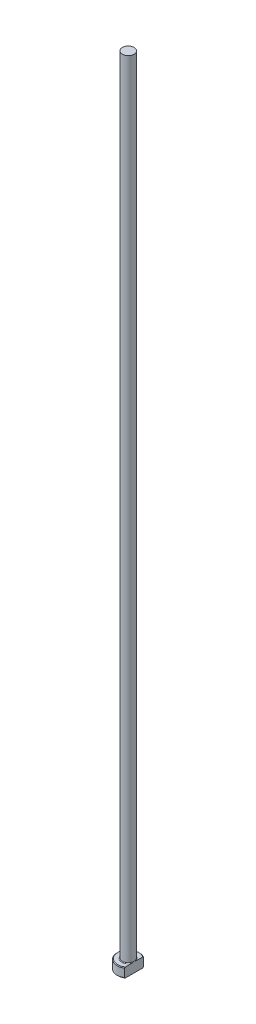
ISO-10303-21;
HEADER;
FILE_DESCRIPTION(('STEP AP214'),'2;1');
FILE_NAME('part.step','',(''),(''),'','','');
FILE_SCHEMA(('AUTOMOTIVE_DESIGN { 1 0 10303 214 1 1 1 1 }'));
ENDSEC;
DATA;
#1=APPLICATION_CONTEXT('core data for automotive mechanical design processes');
#2=APPLICATION_PROTOCOL_DEFINITION('international standard','automotive_design',2000,#1);
#3=PRODUCT_CONTEXT('',#1,'mechanical');
#4=PRODUCT('Part','Part','',(#3));
#5=PRODUCT_RELATED_PRODUCT_CATEGORY('part','',(#4));
#6=PRODUCT_DEFINITION_FORMATION('','',#4);
#7=PRODUCT_DEFINITION_CONTEXT('part definition',#1,'design');
#8=PRODUCT_DEFINITION('design','',#6,#7);
#9=PRODUCT_DEFINITION_SHAPE('','',#8);
#10=(LENGTH_UNIT() NAMED_UNIT(*) SI_UNIT(.MILLI.,.METRE.));
#11=(NAMED_UNIT(*) PLANE_ANGLE_UNIT() SI_UNIT($,.RADIAN.));
#12=(NAMED_UNIT(*) SI_UNIT($,.STERADIAN.) SOLID_ANGLE_UNIT());
#13=UNCERTAINTY_MEASURE_WITH_UNIT(LENGTH_MEASURE(1.E-05),#10,'distance_accuracy_value','');
#14=(GEOMETRIC_REPRESENTATION_CONTEXT(3) GLOBAL_UNCERTAINTY_ASSIGNED_CONTEXT((#13)) GLOBAL_UNIT_ASSIGNED_CONTEXT((#10,
#11,#12)) REPRESENTATION_CONTEXT('',''));
#15=CARTESIAN_POINT('',(0.,0.,0.));
#16=DIRECTION('',(0.,0.,1.));
#17=DIRECTION('',(1.,0.,0.));
#18=AXIS2_PLACEMENT_3D('',#15,#16,#17);
#19=CARTESIAN_POINT('',(0.,0.,0.));
#20=DIRECTION('',(0.,-1.,0.));
#21=DIRECTION('',(0.,0.,-1.));
#22=AXIS2_PLACEMENT_3D('',#19,#20,#21);
#23=PLANE('',#22);
#24=CARTESIAN_POINT('',(0.,0.,0.));
#25=DIRECTION('',(0.,-1.,0.));
#26=DIRECTION('',(0.,0.,-1.));
#27=AXIS2_PLACEMENT_3D('',#24,#25,#26);
#28=CIRCLE('',#27,3.29999999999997);
#29=CARTESIAN_POINT('',(1.84999999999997,0.,2.73267268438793));
#30=VERTEX_POINT('',#29);
#31=CARTESIAN_POINT('',(1.84999999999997,0.,-2.73267268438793));
#32=VERTEX_POINT('',#31);
#33=EDGE_CURVE('E98',#30,#32,#28,.T.);
#34=ORIENTED_EDGE('',*,*,#33,.T.);
#35=DIRECTION('',(0.,0.,1.));
#36=VECTOR('',#35,1.);
#37=CARTESIAN_POINT('',(1.84999999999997,0.,-2.9711109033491));
#38=LINE('',#37,#36);
#39=EDGE_CURVE('E83',#32,#30,#38,.T.);
#40=ORIENTED_EDGE('',*,*,#39,.T.);
#41=EDGE_LOOP('',(#34,#40));
#42=FACE_BOUND('',#41,.T.);
#43=ADVANCED_FACE('F32',(#42),#23,.T.);
#44=CARTESIAN_POINT('',(0.,259.958771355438,0.));
#45=DIRECTION('',(0.,1.,0.));
#46=DIRECTION('',(0.,0.,1.));
#47=AXIS2_PLACEMENT_3D('',#44,#45,#46);
#48=CYLINDRICAL_SURFACE('',#47,3.49999999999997);
#49=CARTESIAN_POINT('',(0.,2.79999999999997,0.));
#50=DIRECTION('',(0.,1.,0.));
#51=DIRECTION('',(0.,0.,1.));
#52=AXIS2_PLACEMENT_3D('',#49,#50,#51);
#53=CIRCLE('',#52,3.49999999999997);
#54=CARTESIAN_POINT('',(1.84999999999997,2.79999999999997,2.9711109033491));
#55=VERTEX_POINT('',#54);
#56=CARTESIAN_POINT('',(1.84999999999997,2.79999999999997,-2.9711109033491));
#57=VERTEX_POINT('',#56);
#58=EDGE_CURVE('E104',#55,#57,#53,.F.);
#59=ORIENTED_EDGE('',*,*,#58,.T.);
#60=DIRECTION('',(0.,-1.,0.));
#61=VECTOR('',#60,1.);
#62=CARTESIAN_POINT('',(1.84999999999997,250.,-2.9711109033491));
#63=LINE('',#62,#61);
#64=CARTESIAN_POINT('',(1.84999999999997,0.199999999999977,-2.9711109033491));
#65=VERTEX_POINT('',#64);
#66=EDGE_CURVE('E183',#57,#65,#63,.T.);
#67=ORIENTED_EDGE('',*,*,#66,.T.);
#68=CARTESIAN_POINT('',(0.,0.199999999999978,0.));
#69=DIRECTION('',(0.,-1.,0.));
#70=DIRECTION('',(0.,0.,-1.));
#71=AXIS2_PLACEMENT_3D('',#68,#69,#70);
#72=CIRCLE('',#71,3.49999999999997);
#73=CARTESIAN_POINT('',(1.84999999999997,0.199999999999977,2.9711109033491));
#74=VERTEX_POINT('',#73);
#75=EDGE_CURVE('E100',#65,#74,#72,.F.);
#76=ORIENTED_EDGE('',*,*,#75,.T.);
#77=DIRECTION('',(0.,-1.,0.));
#78=VECTOR('',#77,1.);
#79=CARTESIAN_POINT('',(1.84999999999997,250.,2.9711109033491));
#80=LINE('',#79,#78);
#81=EDGE_CURVE('E93',#55,#74,#80,.T.);
#82=ORIENTED_EDGE('',*,*,#81,.F.);
#83=EDGE_LOOP('',(#59,#67,#76,#82));
#84=FACE_BOUND('',#83,.T.);
#85=ADVANCED_FACE('F158',(#84),#48,.T.);
#86=CARTESIAN_POINT('',(-3.49999999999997,3.,0.));
#87=DIRECTION('',(0.,1.,0.));
#88=DIRECTION('',(0.,0.,1.));
#89=AXIS2_PLACEMENT_3D('',#86,#87,#88);
#90=PLANE('',#89);
#91=CARTESIAN_POINT('',(0.,3.,0.));
#92=DIRECTION('',(0.,1.,0.));
#93=DIRECTION('',(0.,0.,1.));
#94=AXIS2_PLACEMENT_3D('',#91,#92,#93);
#95=CIRCLE('',#94,3.29999999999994);
#96=CARTESIAN_POINT('',(1.84999999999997,3.,-2.7326726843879));
#97=VERTEX_POINT('',#96);
#98=CARTESIAN_POINT('',(1.84999999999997,3.,2.7326726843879));
#99=VERTEX_POINT('',#98);
#100=EDGE_CURVE('E178',#97,#99,#95,.T.);
#101=ORIENTED_EDGE('',*,*,#100,.T.);
#102=DIRECTION('',(0.,0.,-1.));
#103=VECTOR('',#102,1.);
#104=CARTESIAN_POINT('',(1.84999999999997,3.,0.));
#105=LINE('',#104,#103);
#106=CARTESIAN_POINT('',(1.84999999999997,2.99999999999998,0.883176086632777));
#107=VERTEX_POINT('',#106);
#108=EDGE_CURVE('E57',#99,#107,#105,.T.);
#109=ORIENTED_EDGE('',*,*,#108,.T.);
#110=CARTESIAN_POINT('',(0.,3.,0.));
#111=DIRECTION('',(0.,1.,0.));
#112=DIRECTION('',(0.,0.,1.));
#113=AXIS2_PLACEMENT_3D('',#110,#111,#112);
#114=CIRCLE('',#113,2.04999999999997);
#115=CARTESIAN_POINT('',(1.84999999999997,2.99999999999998,-0.883176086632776));
#116=VERTEX_POINT('',#115);
#117=EDGE_CURVE('E107',#107,#116,#114,.F.);
#118=ORIENTED_EDGE('',*,*,#117,.T.);
#119=EDGE_CURVE('E136',#116,#97,#105,.T.);
#120=ORIENTED_EDGE('',*,*,#119,.T.);
#121=EDGE_LOOP('',(#101,#109,#118,#120));
#122=FACE_BOUND('',#121,.T.);
#123=ADVANCED_FACE('F147',(#122),#90,.T.);
#124=CARTESIAN_POINT('',(0.,3.,0.));
#125=DIRECTION('',(0.,-1.,0.));
#126=DIRECTION('',(0.,0.,-1.));
#127=AXIS2_PLACEMENT_3D('',#124,#125,#126);
#128=CONICAL_SURFACE('',#127,3.29999999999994,0.785398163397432);
#129=ORIENTED_EDGE('',*,*,#58,.F.);
#130=CARTESIAN_POINT('',(1.84999999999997,-0.495337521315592,6.53866286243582));
#131=CARTESIAN_POINT('',(1.84999999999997,-0.367557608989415,6.40586293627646));
#132=CARTESIAN_POINT('',(1.84999999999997,-0.239923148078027,6.27292282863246));
#133=CARTESIAN_POINT('',(1.84999999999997,0.0149855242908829,6.00669544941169));
#134=CARTESIAN_POINT('',(1.84999999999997,0.142259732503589,5.8734081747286));
#135=CARTESIAN_POINT('',(1.84999999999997,0.523515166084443,5.47284424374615));
#136=CARTESIAN_POINT('',(1.84999999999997,0.776848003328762,5.20494969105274));
#137=CARTESIAN_POINT('',(1.84999999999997,1.27905662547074,4.66864873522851));
#138=CARTESIAN_POINT('',(1.84999999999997,1.52795142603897,4.40026022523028));
#139=CARTESIAN_POINT('',(1.84999999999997,1.89802867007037,3.99472739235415));
#140=CARTESIAN_POINT('',(1.84999999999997,2.0208357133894,3.85906701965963));
#141=CARTESIAN_POINT('',(1.84999999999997,2.26498704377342,3.58643788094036));
#142=CARTESIAN_POINT('',(1.84999999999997,2.38633136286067,3.44946914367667));
#143=CARTESIAN_POINT('',(1.84999999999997,2.59253936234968,3.21326235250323));
#144=CARTESIAN_POINT('',(1.84999999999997,2.6778961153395,3.11445520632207));
#145=CARTESIAN_POINT('',(1.84999999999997,2.84729764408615,2.91570924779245));
#146=CARTESIAN_POINT('',(1.84999999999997,2.93134233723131,2.81577036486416));
#147=CARTESIAN_POINT('',(1.84999999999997,3.09808918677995,2.61399668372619));
#148=CARTESIAN_POINT('',(1.84999999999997,3.1807833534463,2.51215526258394));
#149=CARTESIAN_POINT('',(1.84999999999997,3.34381050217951,2.30661634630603));
#150=CARTESIAN_POINT('',(1.84999999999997,3.42414384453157,2.20291913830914));
#151=CARTESIAN_POINT('',(1.84999999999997,3.58217316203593,1.99223162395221));
#152=CARTESIAN_POINT('',(1.84999999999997,3.65984318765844,1.88522173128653));
#153=CARTESIAN_POINT('',(1.84999999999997,3.81046673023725,1.66776579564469));
#154=CARTESIAN_POINT('',(1.84999999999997,3.88341650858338,1.55731712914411));
#155=CARTESIAN_POINT('',(1.84999999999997,4.02186828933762,1.3323802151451));
#156=CARTESIAN_POINT('',(1.84999999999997,4.0873979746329,1.21790922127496));
#157=CARTESIAN_POINT('',(1.84999999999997,4.20734088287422,0.98328899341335));
#158=CARTESIAN_POINT('',(1.84999999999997,4.2617739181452,0.863150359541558));
#159=CARTESIAN_POINT('',(1.84999999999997,4.33092920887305,0.676855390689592));
#160=CARTESIAN_POINT('',(1.84999999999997,4.35204213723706,0.613084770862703));
#161=CARTESIAN_POINT('',(1.84999999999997,4.3887487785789,0.483954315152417));
#162=CARTESIAN_POINT('',(1.84999999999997,4.40434337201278,0.418594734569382));
#163=CARTESIAN_POINT('',(1.84999999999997,4.42895642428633,0.287118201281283));
#164=CARTESIAN_POINT('',(1.84999999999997,4.43802196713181,0.221010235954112));
#165=CARTESIAN_POINT('',(1.84999999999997,4.44908005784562,0.0882006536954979));
#166=CARTESIAN_POINT('',(1.84999999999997,4.4510736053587,0.0214991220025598));
#167=CARTESIAN_POINT('',(1.84999999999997,4.44782172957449,-0.111919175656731));
#168=CARTESIAN_POINT('',(1.84999999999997,4.44255503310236,-0.178635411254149));
#169=CARTESIAN_POINT('',(1.84999999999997,4.42516665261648,-0.311161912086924));
#170=CARTESIAN_POINT('',(1.84999999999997,4.41304353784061,-0.376971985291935));
#171=CARTESIAN_POINT('',(1.84999999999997,4.38266710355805,-0.507684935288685));
#172=CARTESIAN_POINT('',(1.84999999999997,4.36436596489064,-0.572576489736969));
#173=CARTESIAN_POINT('',(1.84999999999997,4.3226826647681,-0.700682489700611));
#174=CARTESIAN_POINT('',(1.84999999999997,4.29930023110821,-0.763896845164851));
#175=CARTESIAN_POINT('',(1.84999999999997,4.24376239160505,-0.900089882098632));
#176=CARTESIAN_POINT('',(1.84999999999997,4.21078445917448,-0.972729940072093));
#177=CARTESIAN_POINT('',(1.84999999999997,4.14042488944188,-1.11586336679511));
#178=CARTESIAN_POINT('',(1.84999999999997,4.10304078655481,-1.18635550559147));
#179=CARTESIAN_POINT('',(1.84999999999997,4.02485037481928,-1.32556755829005));
#180=CARTESIAN_POINT('',(1.84999999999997,3.98403800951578,-1.39428404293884));
#181=CARTESIAN_POINT('',(1.84999999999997,3.89981091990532,-1.53011006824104));
#182=CARTESIAN_POINT('',(1.84999999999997,3.85639567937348,-1.59721928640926));
#183=CARTESIAN_POINT('',(1.84999999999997,3.72220240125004,-1.79793775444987));
#184=CARTESIAN_POINT('',(1.84999999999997,3.62833192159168,-1.92947392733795));
#185=CARTESIAN_POINT('',(1.84999999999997,3.4356113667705,-2.18852608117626));
#186=CARTESIAN_POINT('',(1.84999999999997,3.33676758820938,-2.31604682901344));
#187=CARTESIAN_POINT('',(1.84999999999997,3.16173100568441,-2.53562533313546));
#188=CARTESIAN_POINT('',(1.84999999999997,3.0863122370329,-2.62830296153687));
#189=CARTESIAN_POINT('',(1.84999999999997,2.93402806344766,-2.81246185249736));
#190=CARTESIAN_POINT('',(1.84999999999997,2.8571626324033,-2.90394309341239));
#191=CARTESIAN_POINT('',(1.84999999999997,2.62487459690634,-3.17698997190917));
#192=CARTESIAN_POINT('',(1.84999999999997,2.46778137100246,-3.35713267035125));
#193=CARTESIAN_POINT('',(1.84999999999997,2.15058675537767,-3.71509804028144));
#194=CARTESIAN_POINT('',(1.84999999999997,1.99048215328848,-3.89291784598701));
#195=CARTESIAN_POINT('',(1.84999999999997,1.66834476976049,-4.24677354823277));
#196=CARTESIAN_POINT('',(1.84999999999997,1.50631214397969,-4.42280958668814));
#197=CARTESIAN_POINT('',(1.84999999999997,1.19192013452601,-4.76168963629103));
#198=CARTESIAN_POINT('',(1.84999999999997,1.03965111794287,-4.92461766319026));
#199=CARTESIAN_POINT('',(1.84999999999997,0.734208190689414,-5.24963033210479));
#200=CARTESIAN_POINT('',(1.84999999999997,0.581034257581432,-5.41171495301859));
#201=CARTESIAN_POINT('',(1.84999999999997,0.274298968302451,-5.73490774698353));
#202=CARTESIAN_POINT('',(1.84999999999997,0.120738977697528,-5.89601721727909));
#203=CARTESIAN_POINT('',(1.84999999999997,-0.186924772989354,-6.21770486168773));
#204=CARTESIAN_POINT('',(1.84999999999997,-0.341028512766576,-6.37828305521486));
#205=CARTESIAN_POINT('',(1.84999999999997,-0.495337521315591,-6.53866286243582));
#206=B_SPLINE_CURVE_WITH_KNOTS('',3,(#130,#131,#132,#133,#134,#135,#136,#137,#138,#139,#140,
#141,#142,#143,#144,#145,#146,#147,#148,#149,#150,#151,#152,#153,#154,#155,#156,#157,#158,#159,
#160,#161,#162,#163,#164,#165,#166,#167,#168,#169,#170,#171,#172,#173,#174,#175,#176,#177,#178,
#179,#180,#181,#182,#183,#184,#185,#186,#187,#188,#189,#190,#191,#192,#193,#194,#195,#196,#197,
#198,#199,#200,#201,#202,#203,#204,#205),.UNSPECIFIED.,.F.,.F.,(4,2,2,2,2,2,2,2,2,2,2,2,2,2,2,2,
2,2,2,2,2,2,2,2,2,2,2,2,2,2,2,2,2,2,2,2,2,4),(0.,0.552875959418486,1.10575688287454,
2.21186966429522,3.30993774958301,3.85890041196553,4.40785103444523,4.79955362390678,
5.1912807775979,5.58481647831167,5.97829180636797,6.37488572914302,6.77179001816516,
7.16716102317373,7.56181981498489,7.76314684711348,7.96444174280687,8.16427006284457,
8.36407013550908,8.56445688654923,8.76488546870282,8.96690240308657,9.16893016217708,
9.40805718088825,9.64731865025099,9.88701207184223,10.1267531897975,10.6113114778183,
11.0952709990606,11.4537140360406,11.812163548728,12.5291632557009,13.2469768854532,
13.9647329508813,14.6337450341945,15.3027737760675,15.9704792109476,16.6381599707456),.UNSPECIFIED.);
#207=EDGE_CURVE('E135',#55,#99,#206,.T.);
#208=ORIENTED_EDGE('',*,*,#207,.T.);
#209=ORIENTED_EDGE('',*,*,#100,.F.);
#210=EDGE_CURVE('E127',#97,#57,#206,.T.);
#211=ORIENTED_EDGE('',*,*,#210,.T.);
#212=EDGE_LOOP('',(#129,#208,#209,#211));
#213=FACE_BOUND('',#212,.T.);
#214=ADVANCED_FACE('F143',(#213),#128,.T.);
#215=CARTESIAN_POINT('',(0.,0.199999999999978,0.));
#216=DIRECTION('',(0.,1.,0.));
#217=DIRECTION('',(0.,0.,1.));
#218=AXIS2_PLACEMENT_3D('',#215,#216,#217);
#219=CONICAL_SURFACE('',#218,3.49999999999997,0.785398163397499);
#220=ORIENTED_EDGE('',*,*,#75,.F.);
#221=CARTESIAN_POINT('',(1.84999999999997,3.4953375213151,-6.53866286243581));
#222=CARTESIAN_POINT('',(1.84999999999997,3.36755760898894,-6.40586293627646));
#223=CARTESIAN_POINT('',(1.84999999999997,3.23992314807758,-6.27292282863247));
#224=CARTESIAN_POINT('',(1.84999999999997,2.98501447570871,-6.00669544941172));
#225=CARTESIAN_POINT('',(1.84999999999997,2.85774026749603,-5.87340817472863));
#226=CARTESIAN_POINT('',(1.84999999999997,2.47648483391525,-5.4728442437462));
#227=CARTESIAN_POINT('',(1.84999999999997,2.22315199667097,-5.2049496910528));
#228=CARTESIAN_POINT('',(1.84999999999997,1.72094337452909,-4.6686487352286));
#229=CARTESIAN_POINT('',(1.84999999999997,1.47204857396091,-4.40026022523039));
#230=CARTESIAN_POINT('',(1.84999999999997,1.10197132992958,-3.99472739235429));
#231=CARTESIAN_POINT('',(1.84999999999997,0.979164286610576,-3.85906701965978));
#232=CARTESIAN_POINT('',(1.84999999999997,0.735012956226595,-3.58643788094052));
#233=CARTESIAN_POINT('',(1.84999999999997,0.613668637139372,-3.44946914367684));
#234=CARTESIAN_POINT('',(1.84999999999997,0.407460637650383,-3.2132623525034));
#235=CARTESIAN_POINT('',(1.84999999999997,0.322103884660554,-3.11445520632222));
#236=CARTESIAN_POINT('',(1.84999999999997,0.152702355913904,-2.91570924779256));
#237=CARTESIAN_POINT('',(1.84999999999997,0.0686576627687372,-2.81577036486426));
#238=CARTESIAN_POINT('',(1.84999999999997,-0.0980891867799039,-2.61399668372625));
#239=CARTESIAN_POINT('',(1.84999999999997,-0.180783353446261,-2.51215526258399));
#240=CARTESIAN_POINT('',(1.84999999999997,-0.343810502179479,-2.30661634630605));
#241=CARTESIAN_POINT('',(1.84999999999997,-0.424143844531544,-2.20291913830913));
#242=CARTESIAN_POINT('',(1.84999999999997,-0.582173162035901,-1.99223162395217));
#243=CARTESIAN_POINT('',(1.84999999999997,-0.659843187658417,-1.88522173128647));
#244=CARTESIAN_POINT('',(1.84999999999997,-0.810466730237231,-1.6677657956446));
#245=CARTESIAN_POINT('',(1.84999999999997,-0.883416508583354,-1.557317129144));
#246=CARTESIAN_POINT('',(1.84999999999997,-1.0218682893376,-1.33238021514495));
#247=CARTESIAN_POINT('',(1.84999999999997,-1.08739797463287,-1.21790922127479));
#248=CARTESIAN_POINT('',(1.84999999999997,-1.20734088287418,-0.983288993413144));
#249=CARTESIAN_POINT('',(1.84999999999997,-1.26177391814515,-0.863150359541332));
#250=CARTESIAN_POINT('',(1.84999999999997,-1.33092920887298,-0.676855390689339));
#251=CARTESIAN_POINT('',(1.84999999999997,-1.35204213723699,-0.613084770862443));
#252=CARTESIAN_POINT('',(1.84999999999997,-1.38874877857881,-0.483954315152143));
#253=CARTESIAN_POINT('',(1.84999999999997,-1.40434337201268,-0.4185947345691));
#254=CARTESIAN_POINT('',(1.84999999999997,-1.42895642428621,-0.287118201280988));
#255=CARTESIAN_POINT('',(1.84999999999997,-1.43802196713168,-0.221010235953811));
#256=CARTESIAN_POINT('',(1.84999999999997,-1.44908005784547,-0.0882006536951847));
#257=CARTESIAN_POINT('',(1.84999999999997,-1.45107360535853,-0.0214991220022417));
#258=CARTESIAN_POINT('',(1.84999999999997,-1.4478217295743,0.111919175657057));
#259=CARTESIAN_POINT('',(1.84999999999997,-1.44255503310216,0.178635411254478));
#260=CARTESIAN_POINT('',(1.84999999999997,-1.42516665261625,0.311161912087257));
#261=CARTESIAN_POINT('',(1.84999999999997,-1.41304353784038,0.37697198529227));
#262=CARTESIAN_POINT('',(1.84999999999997,-1.3826671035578,0.507684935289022));
#263=CARTESIAN_POINT('',(1.84999999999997,-1.36436596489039,0.572576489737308));
#264=CARTESIAN_POINT('',(1.84999999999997,-1.32268266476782,0.700682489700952));
#265=CARTESIAN_POINT('',(1.84999999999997,-1.29930023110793,0.763896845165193));
#266=CARTESIAN_POINT('',(1.84999999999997,-1.24376239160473,0.900089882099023));
#267=CARTESIAN_POINT('',(1.84999999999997,-1.21078445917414,0.97272994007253));
#268=CARTESIAN_POINT('',(1.84999999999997,-1.14042488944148,1.11586336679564));
#269=CARTESIAN_POINT('',(1.84999999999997,-1.10304078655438,1.18635550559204));
#270=CARTESIAN_POINT('',(1.84999999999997,-1.02485037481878,1.32556755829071));
#271=CARTESIAN_POINT('',(1.84999999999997,-0.984038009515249,1.39428404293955));
#272=CARTESIAN_POINT('',(1.84999999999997,-0.899810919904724,1.53011006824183));
#273=CARTESIAN_POINT('',(1.84999999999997,-0.856395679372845,1.5972192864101));
#274=CARTESIAN_POINT('',(1.84999999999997,-0.722202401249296,1.79793775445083));
#275=CARTESIAN_POINT('',(1.84999999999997,-0.628331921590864,1.92947392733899));
#276=CARTESIAN_POINT('',(1.84999999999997,-0.43561136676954,2.18852608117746));
#277=CARTESIAN_POINT('',(1.84999999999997,-0.33676758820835,2.31604682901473));
#278=CARTESIAN_POINT('',(1.84999999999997,-0.161731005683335,2.53562533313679));
#279=CARTESIAN_POINT('',(1.84999999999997,-0.0863122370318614,2.62830296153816));
#280=CARTESIAN_POINT('',(1.84999999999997,0.0659719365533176,2.81246185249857));
#281=CARTESIAN_POINT('',(1.84999999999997,0.142837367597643,2.90394309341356));
#282=CARTESIAN_POINT('',(1.84999999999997,0.375125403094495,3.17698997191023));
#283=CARTESIAN_POINT('',(1.84999999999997,0.532218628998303,3.35713267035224));
#284=CARTESIAN_POINT('',(1.84999999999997,0.849413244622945,3.71509804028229));
#285=CARTESIAN_POINT('',(1.84999999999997,1.00951784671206,3.89291784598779));
#286=CARTESIAN_POINT('',(1.84999999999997,1.33165523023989,4.24677354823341));
#287=CARTESIAN_POINT('',(1.84999999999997,1.49368785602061,4.42280958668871));
#288=CARTESIAN_POINT('',(1.84999999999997,1.80807986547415,4.7616896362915));
#289=CARTESIAN_POINT('',(1.84999999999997,1.96034888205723,4.92461766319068));
#290=CARTESIAN_POINT('',(1.84999999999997,2.26579180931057,5.24963033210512));
#291=CARTESIAN_POINT('',(1.84999999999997,2.41896574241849,5.41171495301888));
#292=CARTESIAN_POINT('',(1.84999999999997,2.72570103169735,5.73490774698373));
#293=CARTESIAN_POINT('',(1.84999999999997,2.87926102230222,5.89601721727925));
#294=CARTESIAN_POINT('',(1.84999999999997,3.18692477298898,6.21770486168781));
#295=CARTESIAN_POINT('',(1.84999999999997,3.34102851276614,6.37828305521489));
#296=CARTESIAN_POINT('',(1.84999999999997,3.49533752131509,6.53866286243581));
#297=B_SPLINE_CURVE_WITH_KNOTS('',3,(#221,#222,#223,#224,#225,#226,#227,#228,#229,#230,#231,
#232,#233,#234,#235,#236,#237,#238,#239,#240,#241,#242,#243,#244,#245,#246,#247,#248,#249,#250,
#251,#252,#253,#254,#255,#256,#257,#258,#259,#260,#261,#262,#263,#264,#265,#266,#267,#268,#269,
#270,#271,#272,#273,#274,#275,#276,#277,#278,#279,#280,#281,#282,#283,#284,#285,#286,#287,#288,
#289,#290,#291,#292,#293,#294,#295,#296),.UNSPECIFIED.,.F.,.F.,(4,2,2,2,2,2,2,2,2,2,2,2,2,2,2,2,
2,2,2,2,2,2,2,2,2,2,2,2,2,2,2,2,2,2,2,2,2,4),(0.,0.552875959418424,1.10575688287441,
2.21186966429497,3.30993774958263,3.85890041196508,4.40785103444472,4.79955362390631,
5.19128077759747,5.58481647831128,5.97829180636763,6.37488572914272,6.77179001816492,
7.16716102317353,7.56181981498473,7.76314684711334,7.96444174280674,8.16427006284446,
8.36407013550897,8.56445688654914,8.76488546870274,8.9669024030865,9.16893016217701,
9.40805718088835,9.64731865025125,9.88701207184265,10.1267531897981,10.6113114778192,
11.0952709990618,11.4537140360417,11.812163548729,12.5291632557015,13.2469768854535,
13.9647329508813,14.6337450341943,15.3027737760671,15.970479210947,16.6381599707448),.UNSPECIFIED.);
#298=EDGE_CURVE('E86',#65,#32,#297,.T.);
#299=ORIENTED_EDGE('',*,*,#298,.T.);
#300=ORIENTED_EDGE('',*,*,#33,.F.);
#301=EDGE_CURVE('E89',#30,#74,#297,.T.);
#302=ORIENTED_EDGE('',*,*,#301,.T.);
#303=EDGE_LOOP('',(#220,#299,#300,#302));
#304=FACE_BOUND('',#303,.T.);
#305=ADVANCED_FACE('F97',(#304),#219,.T.);
#306=CARTESIAN_POINT('',(0.,3.19999999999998,0.));
#307=DIRECTION('',(0.,1.,0.));
#308=DIRECTION('',(0.,0.,1.));
#309=AXIS2_PLACEMENT_3D('',#306,#307,#308);
#310=TOROIDAL_SURFACE('',#309,2.04999999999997,0.2);
#311=CARTESIAN_POINT('',(1.84999999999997,3.19999999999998,0.));
#312=CARTESIAN_POINT('',(1.84999999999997,3.2000005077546,9.34667894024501E-11));
#313=CARTESIAN_POINT('',(1.84999999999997,3.20000101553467,-1.39523774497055E-07));
#314=CARTESIAN_POINT('',(1.84999999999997,3.20000198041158,-5.58117212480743E-07));
#315=CARTESIAN_POINT('',(1.84999999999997,3.20000243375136,-8.43654614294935E-07));
#316=CARTESIAN_POINT('',(1.84999999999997,3.20000334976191,-1.52578120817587E-06));
#317=CARTESIAN_POINT('',(1.84999999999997,3.20000380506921,-1.93226270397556E-06));
#318=CARTESIAN_POINT('',(1.84999999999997,3.20000464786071,-2.79453374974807E-06));
#319=CARTESIAN_POINT('',(1.84999999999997,3.2000050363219,-3.24942047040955E-06));
#320=CARTESIAN_POINT('',(1.84999999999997,3.20000639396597,-4.93179089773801E-06));
#321=CARTESIAN_POINT('',(1.84999999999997,3.20000728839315,-6.22116400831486E-06));
#322=CARTESIAN_POINT('',(1.84999999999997,3.20000883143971,-8.83821977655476E-06));
#323=CARTESIAN_POINT('',(1.84999999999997,3.20000949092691,-1.0159828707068E-05));
#324=CARTESIAN_POINT('',(1.84999999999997,3.20001208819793,-1.55027353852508E-05));
#325=CARTESIAN_POINT('',(1.84999999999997,3.20001391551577,-1.95815621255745E-05));
#326=CARTESIAN_POINT('',(1.84999999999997,3.20001678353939,-2.74812027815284E-05));
#327=CARTESIAN_POINT('',(1.84999999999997,3.20001789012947,-3.12784972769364E-05));
#328=CARTESIAN_POINT('',(1.84999999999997,3.20002278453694,-4.79402305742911E-05));
#329=CARTESIAN_POINT('',(1.84999999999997,3.20002665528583,-6.07698221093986E-05));
#330=CARTESIAN_POINT('',(1.84999999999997,3.20003266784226,-8.44896575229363E-05));
#331=CARTESIAN_POINT('',(1.84999999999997,3.20003499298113,-9.53309677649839E-05));
#332=CARTESIAN_POINT('',(1.84999999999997,3.20005390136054,-0.000176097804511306));
#333=CARTESIAN_POINT('',(1.84999999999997,3.20007870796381,-0.000243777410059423));
#334=CARTESIAN_POINT('',(1.84999999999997,3.20017277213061,-0.000509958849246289));
#335=CARTESIAN_POINT('',(1.84999999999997,3.20023587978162,-0.000710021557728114));
#336=CARTESIAN_POINT('',(1.84999999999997,3.20048776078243,-0.00149717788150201));
#337=CARTESIAN_POINT('',(1.84999999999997,3.20068297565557,-0.00208268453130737));
#338=CARTESIAN_POINT('',(1.84999999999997,3.20148579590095,-0.00450164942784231));
#339=CARTESIAN_POINT('',(1.84999999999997,3.20208611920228,-0.00633684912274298));
#340=CARTESIAN_POINT('',(1.84999999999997,3.20840458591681,-0.0256382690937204));
#341=CARTESIAN_POINT('',(1.84999999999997,3.21415962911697,-0.0430958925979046));
#342=CARTESIAN_POINT('',(1.84999999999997,3.22539112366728,-0.0773573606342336));
#343=CARTESIAN_POINT('',(1.84999999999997,3.23086978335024,-0.094160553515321));
#344=CARTESIAN_POINT('',(1.84999999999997,3.24243350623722,-0.129835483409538));
#345=CARTESIAN_POINT('',(1.84999999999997,3.24851108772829,-0.148709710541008));
#346=CARTESIAN_POINT('',(1.84999999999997,3.26060732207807,-0.186696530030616));
#347=CARTESIAN_POINT('',(1.84999999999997,3.26662467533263,-0.205809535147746));
#348=CARTESIAN_POINT('',(1.84999999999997,3.28116945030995,-0.252722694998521));
#349=CARTESIAN_POINT('',(1.84999999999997,3.28960449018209,-0.280551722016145));
#350=CARTESIAN_POINT('',(1.84999999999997,3.30577848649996,-0.335676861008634));
#351=CARTESIAN_POINT('',(1.84999999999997,3.31352939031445,-0.362969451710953));
#352=CARTESIAN_POINT('',(1.84999999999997,3.32966638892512,-0.422337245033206));
#353=CARTESIAN_POINT('',(1.84999999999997,3.33793948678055,-0.454443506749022));
#354=CARTESIAN_POINT('',(1.84999999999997,3.35343207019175,-0.519160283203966));
#355=CARTESIAN_POINT('',(1.84999999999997,3.36064342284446,-0.551772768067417));
#356=CARTESIAN_POINT('',(1.84999999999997,3.37406239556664,-0.619533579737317));
#357=CARTESIAN_POINT('',(1.84999999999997,3.38016747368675,-0.654702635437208));
#358=CARTESIAN_POINT('',(1.84999999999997,3.39023253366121,-0.72534332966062));
#359=CARTESIAN_POINT('',(1.84999999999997,3.39419343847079,-0.76081483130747));
#360=CARTESIAN_POINT('',(1.84999999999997,3.3992299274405,-0.830684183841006));
#361=CARTESIAN_POINT('',(1.84999999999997,3.40040481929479,-0.865074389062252));
#362=CARTESIAN_POINT('',(1.84999999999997,3.39935188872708,-0.933419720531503));
#363=CARTESIAN_POINT('',(1.84999999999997,3.39716621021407,-0.967374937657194));
#364=CARTESIAN_POINT('',(1.84999999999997,3.3892911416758,-1.02700506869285));
#365=CARTESIAN_POINT('',(1.84999999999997,3.3845176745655,-1.0527972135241));
#366=CARTESIAN_POINT('',(1.84999999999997,3.37142827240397,-1.10352321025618));
#367=CARTESIAN_POINT('',(1.84999999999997,3.36311751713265,-1.12845825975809));
#368=CARTESIAN_POINT('',(1.84999999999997,3.34739902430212,-1.16341995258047));
#369=CARTESIAN_POINT('',(1.84999999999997,3.34188173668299,-1.17429318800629));
#370=CARTESIAN_POINT('',(1.84999999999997,3.32959648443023,-1.19534735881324));
#371=CARTESIAN_POINT('',(1.84999999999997,3.32282672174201,-1.20552726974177));
#372=CARTESIAN_POINT('',(1.84999999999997,3.30772953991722,-1.22494096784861));
#373=CARTESIAN_POINT('',(1.84999999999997,3.29937943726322,-1.23415748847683));
#374=CARTESIAN_POINT('',(1.84999999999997,3.28103367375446,-1.25077218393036));
#375=CARTESIAN_POINT('',(1.84999999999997,3.2710465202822,-1.25817929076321));
#376=CARTESIAN_POINT('',(1.84999999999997,3.25422744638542,-1.26760493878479));
#377=CARTESIAN_POINT('',(1.84999999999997,3.24792179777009,-1.27056416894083));
#378=CARTESIAN_POINT('',(1.84999999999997,3.2349110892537,-1.27542089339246));
#379=CARTESIAN_POINT('',(1.84999999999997,3.22820636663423,-1.27731927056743));
#380=CARTESIAN_POINT('',(1.84999999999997,3.21452301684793,-1.27990697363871));
#381=CARTESIAN_POINT('',(1.84999999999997,3.20754302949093,-1.28058924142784));
#382=CARTESIAN_POINT('',(1.84999999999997,3.193576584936,-1.28065770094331));
#383=CARTESIAN_POINT('',(1.84999999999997,3.18659012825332,-1.28004398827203));
#384=CARTESIAN_POINT('',(1.84999999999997,3.17336954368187,-1.27767477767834));
#385=CARTESIAN_POINT('',(1.84999999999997,3.16711869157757,-1.27600999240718));
#386=CARTESIAN_POINT('',(1.84999999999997,3.15494695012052,-1.2717474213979));
#387=CARTESIAN_POINT('',(1.84999999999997,3.14902619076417,-1.26914927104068));
#388=CARTESIAN_POINT('',(1.84999999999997,3.13522495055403,-1.26192664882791));
#389=CARTESIAN_POINT('',(1.84999999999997,3.12755069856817,-1.25690871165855));
#390=CARTESIAN_POINT('',(1.84999999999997,3.11310151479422,-1.24571119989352));
#391=CARTESIAN_POINT('',(1.84999999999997,3.10632887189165,-1.23952876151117));
#392=CARTESIAN_POINT('',(1.84999999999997,3.0902441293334,-1.22278329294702));
#393=CARTESIAN_POINT('',(1.84999999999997,3.08152632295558,-1.21165307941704));
#394=CARTESIAN_POINT('',(1.84999999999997,3.06587834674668,-1.18823434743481));
#395=CARTESIAN_POINT('',(1.84999999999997,3.05894991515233,-1.17594471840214));
#396=CARTESIAN_POINT('',(1.84999999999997,3.04177106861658,-1.14085188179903));
#397=CARTESIAN_POINT('',(1.84999999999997,3.03310568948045,-1.11728001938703));
#398=CARTESIAN_POINT('',(1.84999999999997,3.01913803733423,-1.06899459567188));
#399=CARTESIAN_POINT('',(1.84999999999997,3.01387019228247,-1.04427198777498));
#400=CARTESIAN_POINT('',(1.84999999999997,3.00587460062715,-0.993668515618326));
#401=CARTESIAN_POINT('',(1.84999999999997,3.00322848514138,-0.967775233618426));
#402=CARTESIAN_POINT('',(1.84999999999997,3.00014743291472,-0.915820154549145));
#403=CARTESIAN_POINT('',(1.84999999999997,2.99971730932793,-0.889758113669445));
#404=CARTESIAN_POINT('',(1.84999999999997,3.00104547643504,-0.813795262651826));
#405=CARTESIAN_POINT('',(1.84999999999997,3.00517104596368,-0.763940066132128));
#406=CARTESIAN_POINT('',(1.84999999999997,3.01814671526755,-0.66244627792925));
#407=CARTESIAN_POINT('',(1.84999999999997,3.02721778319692,-0.610839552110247));
#408=CARTESIAN_POINT('',(1.84999999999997,3.04894158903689,-0.507119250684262));
#409=CARTESIAN_POINT('',(1.84999999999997,3.0616746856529,-0.455023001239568));
#410=CARTESIAN_POINT('',(1.84999999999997,3.08496950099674,-0.368082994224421));
#411=CARTESIAN_POINT('',(1.84999999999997,3.09491636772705,-0.333068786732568));
#412=CARTESIAN_POINT('',(1.84999999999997,3.11545203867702,-0.263636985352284));
#413=CARTESIAN_POINT('',(1.84999999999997,3.12603282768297,-0.229217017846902));
#414=CARTESIAN_POINT('',(1.84999999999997,3.14646003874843,-0.164292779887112));
#415=CARTESIAN_POINT('',(1.84999999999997,3.15625955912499,-0.133773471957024));
#416=CARTESIAN_POINT('',(1.84999999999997,3.17649314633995,-0.0715631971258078));
#417=CARTESIAN_POINT('',(1.84999999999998,3.18693679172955,-0.0398752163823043));
#418=CARTESIAN_POINT('',(1.84999999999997,3.19791459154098,-0.00633433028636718));
#419=CARTESIAN_POINT('',(1.84999999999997,3.19851581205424,-0.00449665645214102));
#420=CARTESIAN_POINT('',(1.84999999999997,3.19931885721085,-0.00207711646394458));
#421=CARTESIAN_POINT('',(1.84999999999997,3.19951343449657,-0.00149351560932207));
#422=CARTESIAN_POINT('',(1.84999999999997,3.19976454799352,-0.000708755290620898));
#423=CARTESIAN_POINT('',(1.84999999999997,3.19982750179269,-0.000509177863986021));
#424=CARTESIAN_POINT('',(1.84999999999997,3.19992136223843,-0.000243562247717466));
#425=CARTESIAN_POINT('',(1.84999999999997,3.19994613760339,-0.00017596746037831));
#426=CARTESIAN_POINT('',(1.84999999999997,3.19996502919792,-9.52949953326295E-05));
#427=CARTESIAN_POINT('',(1.84999999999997,3.19996735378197,-8.44593557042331E-05));
#428=CARTESIAN_POINT('',(1.84999999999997,3.19997336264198,-6.07523436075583E-05));
#429=CARTESIAN_POINT('',(1.84999999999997,3.19997722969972,-4.79297585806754E-05));
#430=CARTESIAN_POINT('',(1.84999999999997,3.1999821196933,-3.12758458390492E-05));
#431=CARTESIAN_POINT('',(1.84999999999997,3.19998322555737,-2.74793613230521E-05));
#432=CARTESIAN_POINT('',(1.84999999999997,3.19998609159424,-1.95813053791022E-05));
#433=CARTESIAN_POINT('',(1.84999999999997,3.19998791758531,-1.55032186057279E-05));
#434=CARTESIAN_POINT('',(1.84999999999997,3.19999051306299,-1.01610398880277E-05));
#435=CARTESIAN_POINT('',(1.84999999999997,3.19999117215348,-8.83949266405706E-06));
#436=CARTESIAN_POINT('',(1.84999999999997,3.19999271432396,-6.22248600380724E-06));
#437=CARTESIAN_POINT('',(1.84999999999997,3.19999360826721,-4.93309439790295E-06));
#438=CARTESIAN_POINT('',(1.84999999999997,3.19999496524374,-3.25061146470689E-06));
#439=CARTESIAN_POINT('',(1.84999999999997,3.19999535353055,-2.79567390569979E-06));
#440=CARTESIAN_POINT('',(1.84999999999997,3.19999619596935,-1.93326976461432E-06));
#441=CARTESIAN_POINT('',(1.84999999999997,3.19999665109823,-1.52670538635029E-06));
#442=CARTESIAN_POINT('',(1.84999999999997,3.19999756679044,-8.44380236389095E-07));
#443=CARTESIAN_POINT('',(1.84999999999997,3.19999801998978,-5.58732781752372E-07));
#444=CARTESIAN_POINT('',(1.84999999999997,3.19999898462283,-1.39868280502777E-07));
#445=CARTESIAN_POINT('',(1.84999999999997,3.19999949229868,-9.34569741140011E-11));
#446=CARTESIAN_POINT('',(1.84999999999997,3.19999999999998,0.));
#447=B_SPLINE_CURVE_WITH_KNOTS('',3,(#311,#312,#313,#314,#315,#316,#317,#318,#319,#320,#321,
#322,#323,#324,#325,#326,#327,#328,#329,#330,#331,#332,#333,#334,#335,#336,#337,#338,#339,#340,
#341,#342,#343,#344,#345,#346,#347,#348,#349,#350,#351,#352,#353,#354,#355,#356,#357,#358,#359,
#360,#361,#362,#363,#364,#365,#366,#367,#368,#369,#370,#371,#372,#373,#374,#375,#376,#377,#378,
#379,#380,#381,#382,#383,#384,#385,#386,#387,#388,#389,#390,#391,#392,#393,#394,#395,#396,#397,
#398,#399,#400,#401,#402,#403,#404,#405,#406,#407,#408,#409,#410,#411,#412,#413,#414,#415,#416,
#417,#418,#419,#420,#421,#422,#423,#424,#425,#426,#427,#428,#429,#430,#431,#432,#433,#434,#435,
#436,#437,#438,#439,#440,#441,#442,#443,#444,#445,#446),.UNSPECIFIED.,.T.,.F.,(4,2,2,2,2,2,2,2,
2,2,2,2,2,2,2,2,2,2,2,2,2,2,2,2,2,2,2,2,2,2,2,2,2,2,2,2,2,2,2,2,2,2,2,2,2,2,2,2,2,2,2,2,2,2,2,2,
2,2,2,2,2,2,2,2,2,2,2,4),(0.,1.5255475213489E-06,3.12667082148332E-06,4.94899432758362E-06,
6.74187316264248E-06,1.14287265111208E-05,1.58560812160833E-05,2.9231971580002E-05,
4.10845153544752E-05,8.12839315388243E-05,0.000114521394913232,0.000330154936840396,
0.000960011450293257,0.0028109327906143,0.0086043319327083,0.0637452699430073,0.116767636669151,
0.176252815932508,0.236366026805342,0.323600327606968,0.408710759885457,0.508160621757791,
0.608336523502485,0.715371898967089,0.822361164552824,0.925475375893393,1.02730696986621,
1.10584278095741,1.18426398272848,1.22078073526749,1.25735032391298,1.29449125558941,
1.33144496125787,1.35226401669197,1.37306571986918,1.39398776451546,1.41490826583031,
1.43423216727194,1.45356362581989,1.48091639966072,1.50833734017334,1.55051201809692,
1.59272751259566,1.66764967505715,1.74331958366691,1.82127778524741,1.8994052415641,
2.04914452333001,2.2061992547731,2.36700451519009,2.47619575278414,2.5842176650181,
2.680380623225,2.78046602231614,2.7862672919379,2.78811218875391,2.78874051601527,
2.78895587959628,2.78898910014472,2.78902927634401,2.78904112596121,2.78905449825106,
2.78905892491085,2.78906361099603,2.78906540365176,2.78906722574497,2.78906882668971,
2.78907035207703),.UNSPECIFIED.);
#448=CARTESIAN_POINT('',(1.84999999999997,3.19999999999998,0.));
#449=VERTEX_POINT('',#448);
#450=EDGE_CURVE('E11',#116,#449,#447,.T.);
#451=ORIENTED_EDGE('',*,*,#450,.F.);
#452=ORIENTED_EDGE('',*,*,#117,.F.);
#453=CARTESIAN_POINT('',(1.84999999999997,3.19999999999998,0.));
#454=CARTESIAN_POINT('',(1.84999999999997,3.19999949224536,-9.34668148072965E-11));
#455=CARTESIAN_POINT('',(1.84999999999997,3.19999898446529,1.39523774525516E-07));
#456=CARTESIAN_POINT('',(1.84999999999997,3.19999801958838,5.58117212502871E-07));
#457=CARTESIAN_POINT('',(1.84999999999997,3.19999756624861,8.4365461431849E-07));
#458=CARTESIAN_POINT('',(1.84999999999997,3.19999665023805,1.5257812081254E-06));
#459=CARTESIAN_POINT('',(1.84999999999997,3.19999619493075,1.93226270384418E-06));
#460=CARTESIAN_POINT('',(1.84999999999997,3.19999535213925,2.7945337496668E-06));
#461=CARTESIAN_POINT('',(1.84999999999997,3.19999496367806,3.24942047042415E-06));
#462=CARTESIAN_POINT('',(1.84999999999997,3.19999360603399,4.93179089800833E-06));
#463=CARTESIAN_POINT('',(1.84999999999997,3.19999271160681,6.22116400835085E-06));
#464=CARTESIAN_POINT('',(1.84999999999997,3.19999116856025,8.83821977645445E-06));
#465=CARTESIAN_POINT('',(1.84999999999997,3.19999050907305,1.01598287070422E-05));
#466=CARTESIAN_POINT('',(1.84999999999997,3.19998791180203,1.55027353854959E-05));
#467=CARTESIAN_POINT('',(1.84999999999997,3.19998608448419,1.95815621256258E-05));
#468=CARTESIAN_POINT('',(1.84999999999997,3.19998321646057,2.74812027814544E-05));
#469=CARTESIAN_POINT('',(1.84999999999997,3.19998210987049,3.12784972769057E-05));
#470=CARTESIAN_POINT('',(1.84999999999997,3.19997721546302,4.79402305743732E-05));
#471=CARTESIAN_POINT('',(1.84999999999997,3.19997334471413,6.07698221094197E-05));
#472=CARTESIAN_POINT('',(1.84999999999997,3.1999673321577,8.44896575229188E-05));
#473=CARTESIAN_POINT('',(1.84999999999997,3.19996500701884,9.53309677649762E-05));
#474=CARTESIAN_POINT('',(1.84999999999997,3.19994609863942,0.000176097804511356));
#475=CARTESIAN_POINT('',(1.84999999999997,3.19992129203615,0.000243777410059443));
#476=CARTESIAN_POINT('',(1.84999999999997,3.19982722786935,0.000509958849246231));
#477=CARTESIAN_POINT('',(1.84999999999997,3.19976412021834,0.000710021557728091));
#478=CARTESIAN_POINT('',(1.84999999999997,3.19951223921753,0.00149717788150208));
#479=CARTESIAN_POINT('',(1.84999999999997,3.19931702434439,0.0020826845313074));
#480=CARTESIAN_POINT('',(1.84999999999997,3.19851420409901,0.00450164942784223));
#481=CARTESIAN_POINT('',(1.84999999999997,3.19791388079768,0.00633684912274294));
#482=CARTESIAN_POINT('',(1.84999999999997,3.19159541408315,0.0256382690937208));
#483=CARTESIAN_POINT('',(1.84999999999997,3.18584037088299,0.0430958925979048));
#484=CARTESIAN_POINT('',(1.84999999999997,3.17460887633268,0.0773573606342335));
#485=CARTESIAN_POINT('',(1.84999999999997,3.16913021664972,0.0941605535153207));
#486=CARTESIAN_POINT('',(1.84999999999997,3.15756649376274,0.129835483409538));
#487=CARTESIAN_POINT('',(1.84999999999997,3.15148891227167,0.148709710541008));
#488=CARTESIAN_POINT('',(1.84999999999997,3.13939267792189,0.186696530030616));
#489=CARTESIAN_POINT('',(1.84999999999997,3.13337532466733,0.205809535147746));
#490=CARTESIAN_POINT('',(1.84999999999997,3.11883054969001,0.252722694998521));
#491=CARTESIAN_POINT('',(1.84999999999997,3.11039550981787,0.280551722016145));
#492=CARTESIAN_POINT('',(1.84999999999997,3.0942215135,0.335676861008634));
#493=CARTESIAN_POINT('',(1.84999999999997,3.08647060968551,0.362969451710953));
#494=CARTESIAN_POINT('',(1.84999999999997,3.07033361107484,0.422337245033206));
#495=CARTESIAN_POINT('',(1.84999999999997,3.06206051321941,0.454443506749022));
#496=CARTESIAN_POINT('',(1.84999999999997,3.04656792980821,0.519160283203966));
#497=CARTESIAN_POINT('',(1.84999999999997,3.0393565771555,0.551772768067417));
#498=CARTESIAN_POINT('',(1.84999999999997,3.02593760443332,0.619533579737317));
#499=CARTESIAN_POINT('',(1.84999999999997,3.01983252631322,0.654702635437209));
#500=CARTESIAN_POINT('',(1.84999999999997,3.00976746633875,0.72534332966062));
#501=CARTESIAN_POINT('',(1.84999999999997,3.00580656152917,0.76081483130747));
#502=CARTESIAN_POINT('',(1.84999999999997,3.00077007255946,0.830684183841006));
#503=CARTESIAN_POINT('',(1.84999999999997,2.99959518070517,0.865074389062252));
#504=CARTESIAN_POINT('',(1.84999999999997,3.00064811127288,0.933419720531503));
#505=CARTESIAN_POINT('',(1.84999999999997,3.00283378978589,0.967374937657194));
#506=CARTESIAN_POINT('',(1.84999999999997,3.01070885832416,1.02700506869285));
#507=CARTESIAN_POINT('',(1.84999999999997,3.01548232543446,1.0527972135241));
#508=CARTESIAN_POINT('',(1.84999999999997,3.02857172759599,1.10352321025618));
#509=CARTESIAN_POINT('',(1.84999999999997,3.03688248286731,1.12845825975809));
#510=CARTESIAN_POINT('',(1.84999999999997,3.05260097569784,1.16341995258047));
#511=CARTESIAN_POINT('',(1.84999999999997,3.05811826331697,1.17429318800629));
#512=CARTESIAN_POINT('',(1.84999999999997,3.07040351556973,1.19534735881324));
#513=CARTESIAN_POINT('',(1.84999999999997,3.07717327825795,1.20552726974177));
#514=CARTESIAN_POINT('',(1.84999999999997,3.09227046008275,1.22494096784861));
#515=CARTESIAN_POINT('',(1.84999999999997,3.10062056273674,1.23415748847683));
#516=CARTESIAN_POINT('',(1.84999999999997,3.1189663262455,1.25077218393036));
#517=CARTESIAN_POINT('',(1.84999999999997,3.12895347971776,1.25817929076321));
#518=CARTESIAN_POINT('',(1.84999999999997,3.14577255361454,1.26760493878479));
#519=CARTESIAN_POINT('',(1.84999999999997,3.15207820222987,1.27056416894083));
#520=CARTESIAN_POINT('',(1.84999999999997,3.16508891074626,1.27542089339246));
#521=CARTESIAN_POINT('',(1.84999999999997,3.17179363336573,1.27731927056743));
#522=CARTESIAN_POINT('',(1.84999999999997,3.18547698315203,1.27990697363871));
#523=CARTESIAN_POINT('',(1.84999999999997,3.19245697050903,1.28058924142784));
#524=CARTESIAN_POINT('',(1.84999999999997,3.20642341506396,1.28065770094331));
#525=CARTESIAN_POINT('',(1.84999999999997,3.21340987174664,1.28004398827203));
#526=CARTESIAN_POINT('',(1.84999999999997,3.22663045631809,1.27767477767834));
#527=CARTESIAN_POINT('',(1.84999999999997,3.2328813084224,1.27600999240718));
#528=CARTESIAN_POINT('',(1.84999999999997,3.24505304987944,1.2717474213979));
#529=CARTESIAN_POINT('',(1.84999999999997,3.25097380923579,1.26914927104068));
#530=CARTESIAN_POINT('',(1.84999999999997,3.26477504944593,1.26192664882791));
#531=CARTESIAN_POINT('',(1.84999999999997,3.27244930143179,1.25690871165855));
#532=CARTESIAN_POINT('',(1.84999999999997,3.28689848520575,1.24571119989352));
#533=CARTESIAN_POINT('',(1.84999999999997,3.29367112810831,1.23952876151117));
#534=CARTESIAN_POINT('',(1.84999999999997,3.30975587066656,1.22278329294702));
#535=CARTESIAN_POINT('',(1.84999999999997,3.31847367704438,1.21165307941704));
#536=CARTESIAN_POINT('',(1.84999999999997,3.33412165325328,1.18823434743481));
#537=CARTESIAN_POINT('',(1.84999999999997,3.34105008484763,1.17594471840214));
#538=CARTESIAN_POINT('',(1.84999999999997,3.35822893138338,1.14085188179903));
#539=CARTESIAN_POINT('',(1.84999999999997,3.36689431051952,1.11728001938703));
#540=CARTESIAN_POINT('',(1.84999999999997,3.38086196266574,1.06899459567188));
#541=CARTESIAN_POINT('',(1.84999999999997,3.3861298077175,1.04427198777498));
#542=CARTESIAN_POINT('',(1.84999999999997,3.39412539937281,0.993668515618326));
#543=CARTESIAN_POINT('',(1.84999999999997,3.39677151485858,0.967775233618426));
#544=CARTESIAN_POINT('',(1.84999999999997,3.39985256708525,0.915820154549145));
#545=CARTESIAN_POINT('',(1.84999999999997,3.40028269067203,0.889758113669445));
#546=CARTESIAN_POINT('',(1.84999999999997,3.39895452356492,0.813795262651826));
#547=CARTESIAN_POINT('',(1.84999999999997,3.39482895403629,0.763940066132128));
#548=CARTESIAN_POINT('',(1.84999999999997,3.38185328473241,0.66244627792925));
#549=CARTESIAN_POINT('',(1.84999999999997,3.37278221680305,0.610839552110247));
#550=CARTESIAN_POINT('',(1.84999999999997,3.35105841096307,0.507119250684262));
#551=CARTESIAN_POINT('',(1.84999999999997,3.33832531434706,0.455023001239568));
#552=CARTESIAN_POINT('',(1.84999999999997,3.31503049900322,0.368082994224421));
#553=CARTESIAN_POINT('',(1.84999999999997,3.30508363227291,0.333068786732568));
#554=CARTESIAN_POINT('',(1.84999999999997,3.28454796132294,0.263636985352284));
#555=CARTESIAN_POINT('',(1.84999999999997,3.27396717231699,0.229217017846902));
#556=CARTESIAN_POINT('',(1.84999999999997,3.25353996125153,0.164292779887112));
#557=CARTESIAN_POINT('',(1.84999999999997,3.24374044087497,0.133773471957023));
#558=CARTESIAN_POINT('',(1.84999999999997,3.22350685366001,0.0715631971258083));
#559=CARTESIAN_POINT('',(1.84999999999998,3.21306320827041,0.0398752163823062));
#560=CARTESIAN_POINT('',(1.84999999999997,3.20208540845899,0.00633433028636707));
#561=CARTESIAN_POINT('',(1.84999999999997,3.20148418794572,0.00449665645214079));
#562=CARTESIAN_POINT('',(1.84999999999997,3.20068114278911,0.00207711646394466));
#563=CARTESIAN_POINT('',(1.84999999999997,3.20048656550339,0.00149351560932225));
#564=CARTESIAN_POINT('',(1.84999999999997,3.20023545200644,0.000708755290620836));
#565=CARTESIAN_POINT('',(1.84999999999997,3.20017249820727,0.000509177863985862));
#566=CARTESIAN_POINT('',(1.84999999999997,3.20007863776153,0.00024356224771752));
#567=CARTESIAN_POINT('',(1.84999999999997,3.20005386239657,0.000175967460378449));
#568=CARTESIAN_POINT('',(1.84999999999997,3.20003497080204,9.5294995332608E-05));
#569=CARTESIAN_POINT('',(1.84999999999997,3.20003264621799,8.44593557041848E-05));
#570=CARTESIAN_POINT('',(1.84999999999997,3.20002663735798,6.07523436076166E-05));
#571=CARTESIAN_POINT('',(1.84999999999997,3.20002277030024,4.7929758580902E-05));
#572=CARTESIAN_POINT('',(1.84999999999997,3.20001788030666,3.127584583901E-05));
#573=CARTESIAN_POINT('',(1.84999999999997,3.2000167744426,2.74793613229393E-05));
#574=CARTESIAN_POINT('',(1.84999999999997,3.20001390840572,1.95813053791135E-05));
#575=CARTESIAN_POINT('',(1.84999999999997,3.20001208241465,1.5503218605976E-05));
#576=CARTESIAN_POINT('',(1.84999999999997,3.20000948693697,1.01610398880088E-05));
#577=CARTESIAN_POINT('',(1.84999999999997,3.20000882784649,8.83949266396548E-06));
#578=CARTESIAN_POINT('',(1.84999999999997,3.20000728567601,6.22248600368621E-06));
#579=CARTESIAN_POINT('',(1.84999999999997,3.20000639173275,4.93309439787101E-06));
#580=CARTESIAN_POINT('',(1.84999999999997,3.20000503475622,3.25061146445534E-06));
#581=CARTESIAN_POINT('',(1.84999999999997,3.20000464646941,2.7956739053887E-06));
#582=CARTESIAN_POINT('',(1.84999999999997,3.20000380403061,1.93326976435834E-06));
#583=CARTESIAN_POINT('',(1.84999999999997,3.20000334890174,1.52670538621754E-06));
#584=CARTESIAN_POINT('',(1.84999999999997,3.20000243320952,8.44380236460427E-07));
#585=CARTESIAN_POINT('',(1.84999999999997,3.20000198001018,5.58732781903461E-07));
#586=CARTESIAN_POINT('',(1.84999999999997,3.20000101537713,1.3986828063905E-07));
#587=CARTESIAN_POINT('',(1.84999999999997,3.20000050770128,9.34569995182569E-11));
#588=CARTESIAN_POINT('',(1.84999999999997,3.19999999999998,0.));
#589=B_SPLINE_CURVE_WITH_KNOTS('',3,(#453,#454,#455,#456,#457,#458,#459,#460,#461,#462,#463,
#464,#465,#466,#467,#468,#469,#470,#471,#472,#473,#474,#475,#476,#477,#478,#479,#480,#481,#482,
#483,#484,#485,#486,#487,#488,#489,#490,#491,#492,#493,#494,#495,#496,#497,#498,#499,#500,#501,
#502,#503,#504,#505,#506,#507,#508,#509,#510,#511,#512,#513,#514,#515,#516,#517,#518,#519,#520,
#521,#522,#523,#524,#525,#526,#527,#528,#529,#530,#531,#532,#533,#534,#535,#536,#537,#538,#539,
#540,#541,#542,#543,#544,#545,#546,#547,#548,#549,#550,#551,#552,#553,#554,#555,#556,#557,#558,
#559,#560,#561,#562,#563,#564,#565,#566,#567,#568,#569,#570,#571,#572,#573,#574,#575,#576,#577,
#578,#579,#580,#581,#582,#583,#584,#585,#586,#587,#588),.UNSPECIFIED.,.T.,.F.,(4,2,2,2,2,2,2,2,
2,2,2,2,2,2,2,2,2,2,2,2,2,2,2,2,2,2,2,2,2,2,2,2,2,2,2,2,2,2,2,2,2,2,2,2,2,2,2,2,2,2,2,2,2,2,2,2,
2,2,2,2,2,2,2,2,2,2,2,4),(0.,1.52554752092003E-06,3.12667082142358E-06,4.94899432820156E-06,
6.74187316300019E-06,1.14287265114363E-05,1.5856081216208E-05,2.92319715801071E-05,
4.10845153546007E-05,8.12839315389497E-05,0.000114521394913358,0.000330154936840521,
0.000960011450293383,0.00281093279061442,0.00860433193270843,0.0637452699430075,
0.116767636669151,0.176252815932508,0.236366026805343,0.323600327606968,0.408710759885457,
0.508160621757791,0.608336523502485,0.715371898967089,0.822361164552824,0.925475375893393,
1.02730696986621,1.10584278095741,1.18426398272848,1.22078073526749,1.25735032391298,
1.29449125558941,1.33144496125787,1.35226401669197,1.37306571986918,1.39398776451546,
1.41490826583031,1.43423216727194,1.45356362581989,1.48091639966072,1.50833734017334,
1.55051201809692,1.59272751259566,1.66764967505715,1.74331958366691,1.82127778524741,
1.8994052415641,2.04914452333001,2.2061992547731,2.36700451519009,2.47619575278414,
2.5842176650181,2.680380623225,2.78046602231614,2.7862672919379,2.78811218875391,
2.78874051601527,2.78895587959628,2.78898910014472,2.78902927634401,2.78904112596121,
2.78905449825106,2.78905892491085,2.78906361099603,2.78906540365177,2.78906722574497,
2.78906882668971,2.78907035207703),.UNSPECIFIED.);
#590=EDGE_CURVE('E46',#449,#107,#589,.T.);
#591=ORIENTED_EDGE('',*,*,#590,.F.);
#592=CARTESIAN_POINT('',(0.,3.19999999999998,0.));
#593=DIRECTION('',(0.,1.,0.));
#594=DIRECTION('',(0.,0.,1.));
#595=AXIS2_PLACEMENT_3D('',#592,#593,#594);
#596=CIRCLE('',#595,1.84999999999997);
#597=EDGE_CURVE('E103',#449,#449,#596,.T.);
#598=ORIENTED_EDGE('',*,*,#597,.F.);
#599=EDGE_LOOP('',(#451,#452,#591,#598));
#600=FACE_BOUND('',#599,.T.);
#601=ADVANCED_FACE('F34',(#600),#310,.F.);
#602=CARTESIAN_POINT('',(0.,259.958771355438,0.));
#603=DIRECTION('',(0.,1.,0.));
#604=DIRECTION('',(0.,0.,1.));
#605=AXIS2_PLACEMENT_3D('',#602,#603,#604);
#606=CYLINDRICAL_SURFACE('',#605,1.84999999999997);
#607=ORIENTED_EDGE('',*,*,#597,.T.);
#608=EDGE_LOOP('',(#607));
#609=FACE_BOUND('',#608,.T.);
#610=CARTESIAN_POINT('',(0.,250.,0.));
#611=DIRECTION('',(0.,1.,0.));
#612=DIRECTION('',(0.,0.,1.));
#613=AXIS2_PLACEMENT_3D('',#610,#611,#612);
#614=CIRCLE('',#613,1.84999999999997);
#615=CARTESIAN_POINT('',(0.,250.,1.84999999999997));
#616=VERTEX_POINT('',#615);
#617=EDGE_CURVE('E101',#616,#616,#614,.T.);
#618=ORIENTED_EDGE('',*,*,#617,.F.);
#619=EDGE_LOOP('',(#618));
#620=FACE_BOUND('',#619,.T.);
#621=ADVANCED_FACE('F155',(#609,#620),#606,.T.);
#622=CARTESIAN_POINT('',(-1.84999999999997,250.,0.));
#623=DIRECTION('',(0.,1.,0.));
#624=DIRECTION('',(0.,0.,1.));
#625=AXIS2_PLACEMENT_3D('',#622,#623,#624);
#626=PLANE('',#625);
#627=ORIENTED_EDGE('',*,*,#617,.T.);
#628=EDGE_LOOP('',(#627));
#629=FACE_BOUND('',#628,.T.);
#630=ADVANCED_FACE('F121',(#629),#626,.T.);
#631=CARTESIAN_POINT('',(1.84999999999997,250.,-2.9711109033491));
#632=DIRECTION('',(1.,0.,0.));
#633=DIRECTION('',(0.,0.,-1.));
#634=AXIS2_PLACEMENT_3D('',#631,#632,#633);
#635=PLANE('',#634);
#636=ORIENTED_EDGE('',*,*,#66,.F.);
#637=ORIENTED_EDGE('',*,*,#210,.F.);
#638=ORIENTED_EDGE('',*,*,#119,.F.);
#639=ORIENTED_EDGE('',*,*,#450,.T.);
#640=ORIENTED_EDGE('',*,*,#590,.T.);
#641=ORIENTED_EDGE('',*,*,#108,.F.);
#642=ORIENTED_EDGE('',*,*,#207,.F.);
#643=ORIENTED_EDGE('',*,*,#81,.T.);
#644=ORIENTED_EDGE('',*,*,#301,.F.);
#645=ORIENTED_EDGE('',*,*,#39,.F.);
#646=ORIENTED_EDGE('',*,*,#298,.F.);
#647=EDGE_LOOP('',(#636,#637,#638,#639,#640,#641,#642,#643,#644,#645,#646));
#648=FACE_BOUND('',#647,.T.);
#649=ADVANCED_FACE('F85',(#648),#635,.T.);
#650=CLOSED_SHELL('',(#43,#85,#123,#214,#305,#601,#621,#630,#649));
#651=MANIFOLD_SOLID_BREP('B2',#650);
#652=ADVANCED_BREP_SHAPE_REPRESENTATION('',(#18,#651),#14);
#653=SHAPE_DEFINITION_REPRESENTATION(#9,#652);
ENDSEC;
END-ISO-10303-21;
